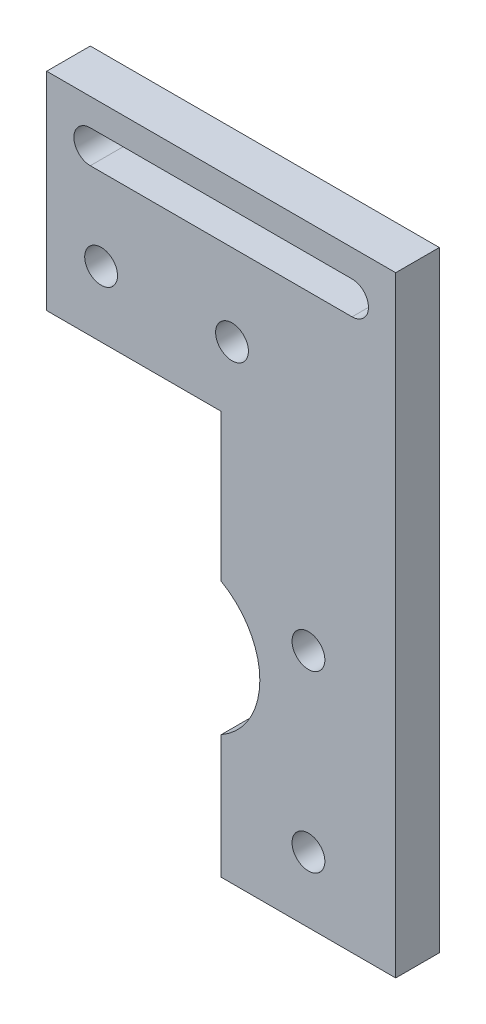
from build123d import *

# Parameters (mm, degrees)
SKETCH2_R           = 2.3876
BOSS_EXTRUDE1_DEPTH = 6.35
SKETCH3_R           = 11.1125
CUT_EXTRUDE1_DEPTH  = 12.7


with BuildPart() as part:
    # Sketch2 → Boss-Extrude1 (new body)
    with BuildSketch(Plane.XY):
        Polygon((-12.7, -9.525), (12.7, -9.525), (12.7, 79.375), (-38.1, 79.375), (-38.1, 49.1998), (-12.7, 49.1998), align=None)
        Circle(SKETCH2_R, mode=Mode.SUBTRACT)
        with Locations((0, 25.4)):
            Circle(SKETCH2_R, mode=Mode.SUBTRACT)
        with Locations((-30.1752, 58.7502)):
            Circle(SKETCH2_R, mode=Mode.SUBTRACT)
        with Locations((-11.1252, 58.7502)):
            Circle(SKETCH2_R, mode=Mode.SUBTRACT)
        with BuildLine():
            Line((-31.75, 70.6374), (6.35, 70.6374))
            ThreePointArc((6.35, 70.6374), (8.7376, 73.025), (6.35, 75.4126))
            Line((6.35, 75.4126), (-31.75, 75.4126))
            ThreePointArc((-31.75, 75.4126), (-34.1376, 73.025), (-31.75, 70.6374))
        make_face(mode=Mode.SUBTRACT)
    extrude(amount=BOSS_EXTRUDE1_DEPTH)

    # Sketch3 → Cut-Extrude1 (cut)
    with BuildSketch(Plane.XY):
        with Locations((-18.1864, 18.1102)):
            Circle(SKETCH3_R)
    extrude(amount=CUT_EXTRUDE1_DEPTH, mode=Mode.SUBTRACT)


solid = part.part
